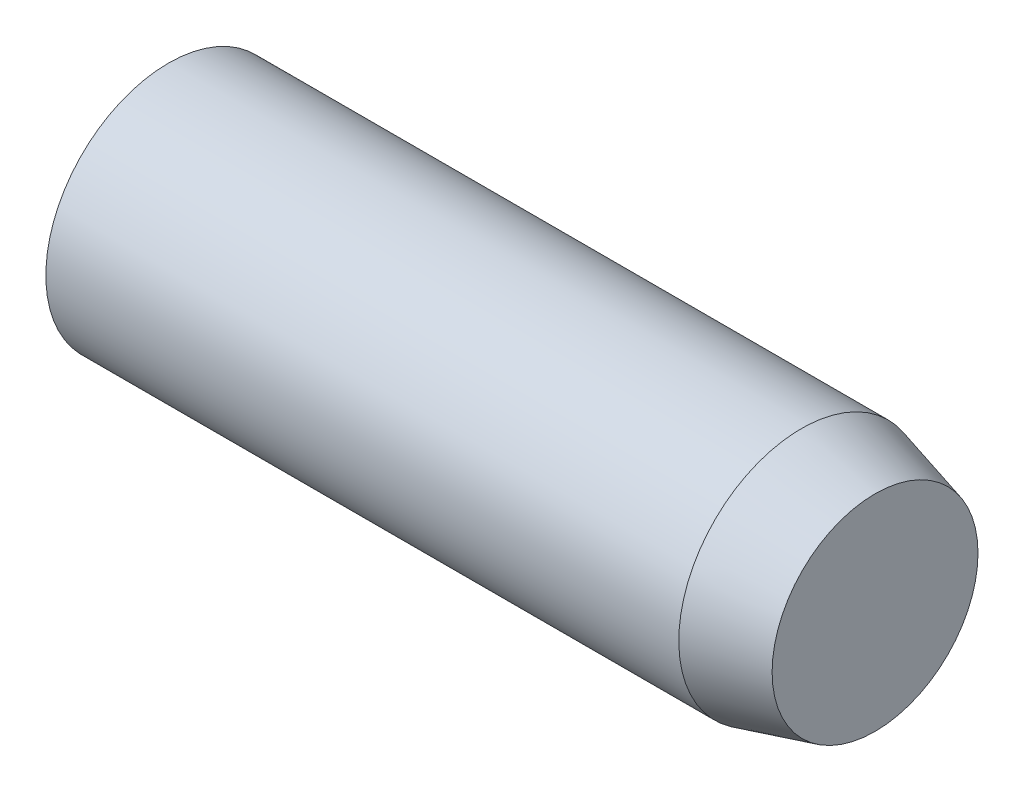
from build123d import *


with BuildPart() as part:
    # BodySke → Body (revolve)
    with BuildSketch(Plane.XY, mode=Mode.PRIVATE) as body_sk:
        with BuildLine():
            Line((27, 5), (30, 4.196152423))
            Line((30, 4.196152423), (30, 0))
            Line((30, 0), (0, 0))
            ThreePointArc((0, 0), (0.30419989, 2.570992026), (1.2, 5))
            Line((1.2, 5), (27, 5))
        make_face()
    revolve(body_sk.sketch.rotate(Axis((0, 0, 0), (1, 0, 0)), 180), axis=Axis((0, 0, 0), (1, 0, 0)))


solid = part.part
